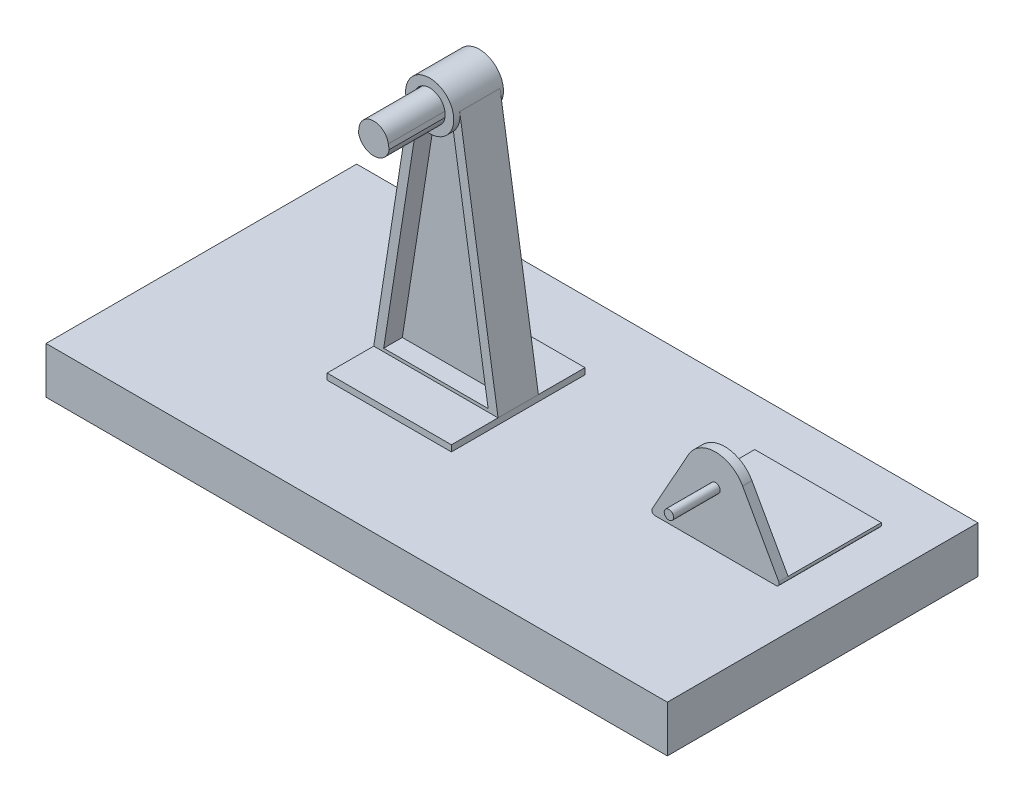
from build123d import *

# Parameters (mm, degrees)
ESQUISSE1_W             = 200
ESQUISSE1_H             = 15
BOSS_EXTRU_1_DEPTH      = 50
BOSS_EXTRU_2_DEPTH      = 3
BOSS_EXTRU_3_DEPTH      = 30
ESQUISSE4_R             = 1.5
BOSS_EXTRU_4_DEPTH      = 15
ESQUISSE5_W             = 40
ESQUISSE5_H             = 2
BOSS_EXTRU_6_DEPTH      = 13
ENL_V_MAT_EXTRU_1_DEPTH = 6
BOSS_EXTRU_7_DEPTH      = 8
BOSS_EXTRU_7_DEPTH_BACK = 8
ESQUISSE7_R             = 7.75
ESQUISSE7_R_2           = 5
ENL_V_MAT_EXTRU_2_DEPTH = 6
BOSS_EXTRU_8_START      = 26
BOSS_EXTRU_8_DEPTH      = 26
ESQUISSE11_W            = 40
ESQUISSE11_H            = 2
BOSS_EXTRU_9_DEPTH      = 15
ESQUISSE12_W            = 40
ESQUISSE12_H            = 2
BOSS_EXTRU_10_DEPTH     = 15


with BuildPart() as part:
    # Esquisse1 → Boss.-Extru.1 (new, symmetric)
    with BuildSketch(Plane.XY):
        Rectangle(ESQUISSE1_W, ESQUISSE1_H)
    extrude(amount=BOSS_EXTRU_1_DEPTH, both=True)

    # Esquisse2 → Boss.-Extru.2 (add)
    with BuildSketch(Plane.XY):
        with BuildLine():
            Line((85, 7.5), (46, 7.5))
            ThreePointArc((46, 7.5), (45.137779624, 7.993466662), (45.126513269, 8.986847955))
            Line((45.126513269, 8.986847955), (56.765132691, 29.868479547))
            ThreePointArc((56.765132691, 29.868479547), (65.5, 35), (74.234867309, 29.868479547))
            Line((74.234867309, 29.868479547), (85.873486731, 8.986847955))
            ThreePointArc((85.873486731, 8.986847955), (85.862220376, 7.993466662), (85, 7.5))
        make_face()
    extrude(amount=-BOSS_EXTRU_2_DEPTH)

    # Esquisse3 → Boss.-Extru.3 (add)
    with BuildSketch(Plane(origin=(0, 0, -3), x_dir=(-1, 0, 0), z_dir=(0, 0, -1))):
        with BuildLine():
            Line((-45.126513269, 8.986847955), (-85.873486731, 8.986847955))
            ThreePointArc((-85.873486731, 8.986847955), (-85.862220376, 7.993466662), (-85, 7.5))
            Line((-85, 7.5), (-46, 7.5))
            ThreePointArc((-46, 7.5), (-45.137779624, 7.993466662), (-45.126513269, 8.986847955))
        make_face()
    extrude(amount=BOSS_EXTRU_3_DEPTH)

    # Esquisse4 → Boss.-Extru.4 (add)
    with BuildSketch(Plane.XY):
        with Locations(Location((65.5, 25, 0), (0, 0, 180))):
            Circle(ESQUISSE4_R)
    extrude(amount=BOSS_EXTRU_4_DEPTH)

    # Esquisse5 → Boss.-Extru.6 (add)
    with BuildSketch(Plane.XY):
        with BuildLine():
            ThreePointArc((-32.157557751, 88.693444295), (-24.5, 95.25), (-16.842442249, 88.693444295))
            Line((-16.842442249, 88.693444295), (-4.5, 9.5))
            Line((-4.5, 9.5), (-44.5, 9.5))
            Line((-44.5, 9.5), (-32.157557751, 88.693444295))
        make_face()
        with Locations((-24.5, 8.5)):
            Rectangle(ESQUISSE5_W, ESQUISSE5_H)
    extrude(amount=-BOSS_EXTRU_6_DEPTH)

    # Esquisse6 → Enl_v. mat.-Extru.1 (cut)
    with BuildSketch(Plane.XY):
        with BuildLine():
            Line((-29.193341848, 88.231465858), (-41.307932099, 10.5))
            Line((-41.307932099, 10.5), (-7.692067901, 10.5))
            Line((-7.692067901, 10.5), (-19.806658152, 88.231465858))
            ThreePointArc((-19.806658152, 88.231465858), (-24.5, 92.25), (-29.193341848, 88.231465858))
        make_face()
    extrude(amount=-ENL_V_MAT_EXTRU_1_DEPTH, mode=Mode.SUBTRACT)

    # Esquisse7 → Boss.-Extru.7 (add, two sides: drawn at the far end of the back side and taken through both)
    with BuildSketch(Plane.XY.offset(-6).offset(-BOSS_EXTRU_7_DEPTH_BACK)):
        with Locations((-24.5, 87.5)):
            Circle(ESQUISSE7_R)
        with Locations((-24.5, 87.5)):
            Circle(ESQUISSE7_R_2, mode=Mode.SUBTRACT)
    extrude(amount=BOSS_EXTRU_7_DEPTH + BOSS_EXTRU_7_DEPTH_BACK)

    # Esquisse3D1 → Enl_v. mat.-Extru.2 (cut)
    with BuildSketch(Plane(origin=(-18.321608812, 78.702867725, -13), x_dir=(-0.3193776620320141, -0.9476275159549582, 0), z_dir=(0, 0, 1))):
        with BuildLine():
            Line((0, 0), (61.236076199, 31.855317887))
            Line((61.236076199, 31.855317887), (71.972232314, 0))
            Line((71.972232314, 0), (3.946480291, -11.709626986))
            add(Edge.make_bspline(
                [(3.946480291, -11.709626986), (4.014610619, -11.478944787), (4.076295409, -11.246357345), (4.131469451, -11.012107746), (4.25608645, -10.407797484), (4.33703575, -9.795754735), (4.370082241, -9.420475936), (4.403337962, -8.667992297), (4.37058158, -7.915485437), (4.33778408, -7.540184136), (4.239517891, -6.793401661), (4.076244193, -6.058091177), (3.978604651, -5.694232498), (3.751818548, -4.975965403), (3.463015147, -4.280313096), (3.303516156, -3.939011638), (2.955137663, -3.271200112), (2.549626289, -2.636455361), (2.333139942, -2.328136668), (1.873811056, -1.731180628), (1.363980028, -1.176735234), (1.097119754, -0.910818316), (0.71937195, -0.565927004), (0.322101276, -0.244393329), (0.216007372, -0.161245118), (0.108628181, -0.079772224), (0, 0)],
                knots=[0, 0, 0, 0, 0, 0, 0.091359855, 0.091359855, 0.091359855, 0.234268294, 0.234268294, 0.234268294, 0.377176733, 0.377176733, 0.377176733, 0.520085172, 0.520085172, 0.520085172, 0.662993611, 0.662993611, 0.662993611, 0.80590205, 0.80590205, 0.80590205, 0.948810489, 0.948810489, 0.948810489, 1, 1, 1, 1, 1, 1], degree=5))
        make_face()
    extrude(amount=ENL_V_MAT_EXTRU_2_DEPTH, mode=Mode.SUBTRACT)

    # Esquisse10 → Boss.-Extru.8 (add)
    with BuildSketch(Plane.XY.offset(-6).offset(BOSS_EXTRU_8_START)):
        with BuildLine():
            Line((-29.193341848, 88.231465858), (-29.433763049, 86.688838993))
            ThreePointArc((-29.433763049, 86.688838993), (-24.5, 82.5), (-19.566236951, 86.688838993))
            Line((-19.566236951, 86.688838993), (-19.806658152, 88.231465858))
            ThreePointArc((-19.806658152, 88.231465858), (-24.5, 92.25), (-29.193341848, 88.231465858))
        make_face()
    extrude(amount=-BOSS_EXTRU_8_DEPTH)

    # Esquisse11 → Boss.-Extru.9 (add)
    with BuildSketch(Plane.XY):
        with Locations((-24.5, 8.5)):
            Rectangle(ESQUISSE11_W, ESQUISSE11_H)
    extrude(amount=BOSS_EXTRU_9_DEPTH)

    # Esquisse12 → Boss.-Extru.10 (add)
    with BuildSketch(Plane(origin=(0, 0, -13), x_dir=(-1, 0, 0), z_dir=(0, 0, -1))):
        with Locations((24.5, 8.5)):
            Rectangle(ESQUISSE12_W, ESQUISSE12_H)
    extrude(amount=BOSS_EXTRU_10_DEPTH)


solid = part.part
